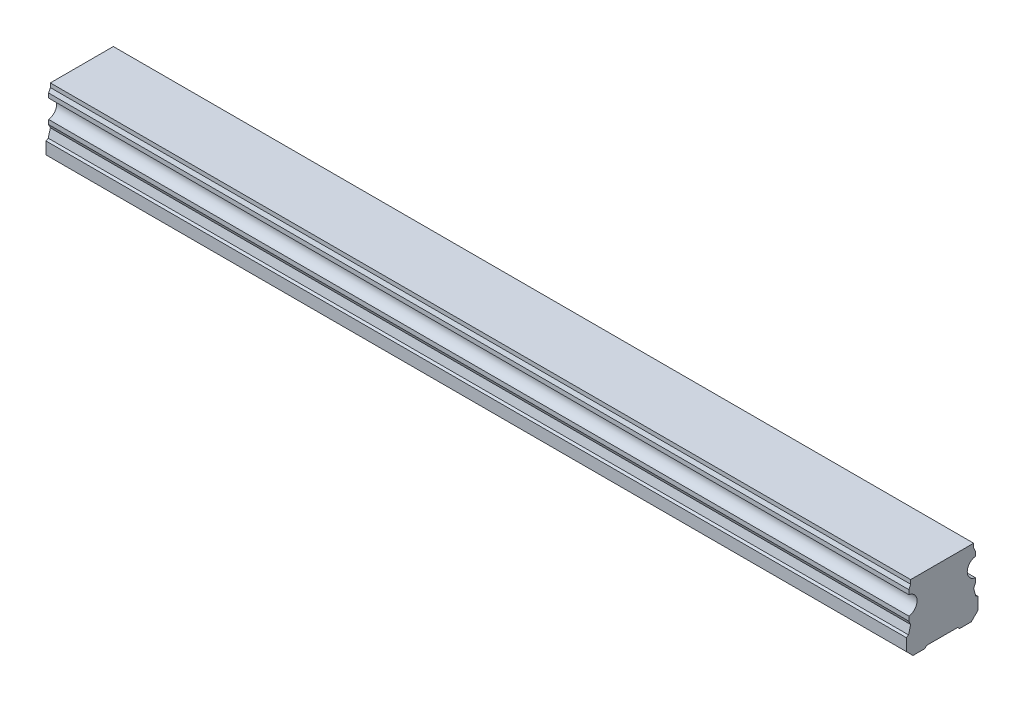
ISO-10303-21;
HEADER;
FILE_DESCRIPTION(('STEP AP214'),'2;1');
FILE_NAME('part.step','',(''),(''),'','','');
FILE_SCHEMA(('AUTOMOTIVE_DESIGN { 1 0 10303 214 1 1 1 1 }'));
ENDSEC;
DATA;
#1=APPLICATION_CONTEXT('core data for automotive mechanical design processes');
#2=APPLICATION_PROTOCOL_DEFINITION('international standard','automotive_design',2000,#1);
#3=PRODUCT_CONTEXT('',#1,'mechanical');
#4=PRODUCT('Part','Part','',(#3));
#5=PRODUCT_RELATED_PRODUCT_CATEGORY('part','',(#4));
#6=PRODUCT_DEFINITION_FORMATION('','',#4);
#7=PRODUCT_DEFINITION_CONTEXT('part definition',#1,'design');
#8=PRODUCT_DEFINITION('design','',#6,#7);
#9=PRODUCT_DEFINITION_SHAPE('','',#8);
#10=(LENGTH_UNIT() NAMED_UNIT(*) SI_UNIT(.MILLI.,.METRE.));
#11=(NAMED_UNIT(*) PLANE_ANGLE_UNIT() SI_UNIT($,.RADIAN.));
#12=(NAMED_UNIT(*) SI_UNIT($,.STERADIAN.) SOLID_ANGLE_UNIT());
#13=UNCERTAINTY_MEASURE_WITH_UNIT(LENGTH_MEASURE(1.E-05),#10,'distance_accuracy_value','');
#14=(GEOMETRIC_REPRESENTATION_CONTEXT(3) GLOBAL_UNCERTAINTY_ASSIGNED_CONTEXT((#13)) GLOBAL_UNIT_ASSIGNED_CONTEXT((#10,
#11,#12)) REPRESENTATION_CONTEXT('',''));
#15=CARTESIAN_POINT('',(0.,0.,0.));
#16=DIRECTION('',(0.,0.,1.));
#17=DIRECTION('',(1.,0.,0.));
#18=AXIS2_PLACEMENT_3D('',#15,#16,#17);
#19=CARTESIAN_POINT('',(150.,0.399999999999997,0.));
#20=DIRECTION('',(0.,-1.,0.));
#21=DIRECTION('',(0.,0.,-1.));
#22=AXIS2_PLACEMENT_3D('',#19,#20,#21);
#23=CONICAL_SURFACE('',#22,2.89999999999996,0.78539816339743);
#24=CARTESIAN_POINT('',(150.,0.799999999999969,0.));
#25=DIRECTION('',(0.,1.,0.));
#26=DIRECTION('',(0.,0.,1.));
#27=AXIS2_PLACEMENT_3D('',#24,#25,#26);
#28=CIRCLE('',#27,2.5);
#29=CARTESIAN_POINT('',(150.,0.799999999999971,2.5));
#30=VERTEX_POINT('',#29);
#31=EDGE_CURVE('E11',#30,#30,#28,.F.);
#32=ORIENTED_EDGE('',*,*,#31,.F.);
#33=EDGE_LOOP('',(#32));
#34=FACE_BOUND('',#33,.T.);
#35=CARTESIAN_POINT('',(150.,0.399999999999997,0.));
#36=DIRECTION('',(0.,1.,0.));
#37=DIRECTION('',(0.,0.,1.));
#38=AXIS2_PLACEMENT_3D('',#35,#36,#37);
#39=CIRCLE('',#38,2.89999999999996);
#40=CARTESIAN_POINT('',(150.,0.399999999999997,2.89999999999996));
#41=VERTEX_POINT('',#40);
#42=EDGE_CURVE('E433',#41,#41,#39,.T.);
#43=ORIENTED_EDGE('',*,*,#42,.F.);
#44=EDGE_LOOP('',(#43));
#45=FACE_BOUND('',#44,.T.);
#46=ADVANCED_FACE('F39',(#34,#45),#23,.F.);
#47=CARTESIAN_POINT('',(150.,7.,0.));
#48=DIRECTION('',(0.,-1.,0.));
#49=DIRECTION('',(0.,0.,-1.));
#50=AXIS2_PLACEMENT_3D('',#47,#48,#49);
#51=CYLINDRICAL_SURFACE('',#50,2.5);
#52=ORIENTED_EDGE('',*,*,#31,.T.);
#53=EDGE_LOOP('',(#52));
#54=FACE_BOUND('',#53,.T.);
#55=CARTESIAN_POINT('',(150.,7.,0.));
#56=DIRECTION('',(0.,-1.,0.));
#57=DIRECTION('',(0.,0.,-1.));
#58=AXIS2_PLACEMENT_3D('',#55,#56,#57);
#59=CIRCLE('',#58,2.5);
#60=CARTESIAN_POINT('',(150.,7.,-2.50000000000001));
#61=VERTEX_POINT('',#60);
#62=EDGE_CURVE('E49',#61,#61,#59,.T.);
#63=ORIENTED_EDGE('',*,*,#62,.F.);
#64=EDGE_LOOP('',(#63));
#65=FACE_BOUND('',#64,.T.);
#66=ADVANCED_FACE('F572',(#54,#65),#51,.F.);
#67=CARTESIAN_POINT('',(150.,7.,0.));
#68=DIRECTION('',(0.,-1.,0.));
#69=DIRECTION('',(0.,0.,-1.));
#70=AXIS2_PLACEMENT_3D('',#67,#68,#69);
#71=PLANE('',#70);
#72=CARTESIAN_POINT('',(150.,7.,0.));
#73=DIRECTION('',(0.,-1.,0.));
#74=DIRECTION('',(0.,0.,-1.));
#75=AXIS2_PLACEMENT_3D('',#72,#73,#74);
#76=CIRCLE('',#75,2.1);
#77=CARTESIAN_POINT('',(150.,7.,-2.1));
#78=VERTEX_POINT('',#77);
#79=EDGE_CURVE('E42',#78,#78,#76,.T.);
#80=ORIENTED_EDGE('',*,*,#79,.F.);
#81=EDGE_LOOP('',(#80));
#82=FACE_BOUND('',#81,.T.);
#83=ORIENTED_EDGE('',*,*,#62,.T.);
#84=EDGE_LOOP('',(#83));
#85=FACE_BOUND('',#84,.T.);
#86=ADVANCED_FACE('F577',(#82,#85),#71,.T.);
#87=CARTESIAN_POINT('',(180.,14.,-6.59000000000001));
#88=DIRECTION('',(0.,0.,1.));
#89=DIRECTION('',(0.,-1.,0.));
#90=AXIS2_PLACEMENT_3D('',#87,#88,#89);
#91=PLANE('',#90);
#92=DIRECTION('',(0.,1.,0.));
#93=VECTOR('',#92,1.);
#94=CARTESIAN_POINT('',(0.,14.,-6.59000000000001));
#95=LINE('',#94,#93);
#96=CARTESIAN_POINT('',(0.,13.15,-6.59));
#97=VERTEX_POINT('',#96);
#98=CARTESIAN_POINT('',(0.,14.,-6.59000000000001));
#99=VERTEX_POINT('',#98);
#100=EDGE_CURVE('E255',#97,#99,#95,.T.);
#101=ORIENTED_EDGE('',*,*,#100,.T.);
#102=DIRECTION('',(-1.,0.,0.));
#103=VECTOR('',#102,1.);
#104=CARTESIAN_POINT('',(180.,14.,-6.59000000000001));
#105=LINE('',#104,#103);
#106=CARTESIAN_POINT('',(180.,14.,-6.59000000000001));
#107=VERTEX_POINT('',#106);
#108=EDGE_CURVE('E422',#107,#99,#105,.T.);
#109=ORIENTED_EDGE('',*,*,#108,.F.);
#110=DIRECTION('',(0.,1.,0.));
#111=VECTOR('',#110,1.);
#112=CARTESIAN_POINT('',(180.,14.,-6.59000000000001));
#113=LINE('',#112,#111);
#114=CARTESIAN_POINT('',(180.,13.15,-6.59));
#115=VERTEX_POINT('',#114);
#116=EDGE_CURVE('E331',#115,#107,#113,.T.);
#117=ORIENTED_EDGE('',*,*,#116,.F.);
#118=DIRECTION('',(-1.,0.,0.));
#119=VECTOR('',#118,1.);
#120=CARTESIAN_POINT('',(180.,13.15,-6.59));
#121=LINE('',#120,#119);
#122=EDGE_CURVE('E251',#115,#97,#121,.T.);
#123=ORIENTED_EDGE('',*,*,#122,.T.);
#124=EDGE_LOOP('',(#101,#109,#117,#123));
#125=FACE_BOUND('',#124,.T.);
#126=ADVANCED_FACE('F559',(#125),#91,.F.);
#127=CARTESIAN_POINT('',(180.,14.,-6.59000000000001));
#128=DIRECTION('',(0.,-1.,0.));
#129=DIRECTION('',(0.,0.,-1.));
#130=AXIS2_PLACEMENT_3D('',#127,#128,#129);
#131=PLANE('',#130);
#132=DIRECTION('',(0.,0.,1.));
#133=VECTOR('',#132,1.);
#134=CARTESIAN_POINT('',(0.,14.,-6.59000000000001));
#135=LINE('',#134,#133);
#136=CARTESIAN_POINT('',(0.,14.,6.59));
#137=VERTEX_POINT('',#136);
#138=EDGE_CURVE('E259',#99,#137,#135,.T.);
#139=ORIENTED_EDGE('',*,*,#138,.T.);
#140=DIRECTION('',(-1.,0.,0.));
#141=VECTOR('',#140,1.);
#142=CARTESIAN_POINT('',(180.,14.,6.59));
#143=LINE('',#142,#141);
#144=CARTESIAN_POINT('',(180.,14.,6.59));
#145=VERTEX_POINT('',#144);
#146=EDGE_CURVE('E418',#145,#137,#143,.T.);
#147=ORIENTED_EDGE('',*,*,#146,.F.);
#148=DIRECTION('',(0.,0.,1.));
#149=VECTOR('',#148,1.);
#150=CARTESIAN_POINT('',(180.,14.,-6.59000000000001));
#151=LINE('',#150,#149);
#152=EDGE_CURVE('E157',#107,#145,#151,.T.);
#153=ORIENTED_EDGE('',*,*,#152,.F.);
#154=ORIENTED_EDGE('',*,*,#108,.T.);
#155=EDGE_LOOP('',(#139,#147,#153,#154));
#156=FACE_BOUND('',#155,.T.);
#157=ADVANCED_FACE('F644',(#156),#131,.F.);
#158=CARTESIAN_POINT('',(180.,14.,6.59));
#159=DIRECTION('',(0.,0.,-1.));
#160=DIRECTION('',(0.,1.,0.));
#161=AXIS2_PLACEMENT_3D('',#158,#159,#160);
#162=PLANE('',#161);
#163=DIRECTION('',(0.,-1.,0.));
#164=VECTOR('',#163,1.);
#165=CARTESIAN_POINT('',(0.,14.,6.59));
#166=LINE('',#165,#164);
#167=CARTESIAN_POINT('',(0.,13.15,6.59));
#168=VERTEX_POINT('',#167);
#169=EDGE_CURVE('E263',#137,#168,#166,.T.);
#170=ORIENTED_EDGE('',*,*,#169,.T.);
#171=DIRECTION('',(-1.,0.,0.));
#172=VECTOR('',#171,1.);
#173=CARTESIAN_POINT('',(180.,13.15,6.59));
#174=LINE('',#173,#172);
#175=CARTESIAN_POINT('',(180.,13.15,6.59));
#176=VERTEX_POINT('',#175);
#177=EDGE_CURVE('E414',#176,#168,#174,.T.);
#178=ORIENTED_EDGE('',*,*,#177,.F.);
#179=DIRECTION('',(0.,-1.,0.));
#180=VECTOR('',#179,1.);
#181=CARTESIAN_POINT('',(180.,14.,6.59));
#182=LINE('',#181,#180);
#183=EDGE_CURVE('E485',#145,#176,#182,.T.);
#184=ORIENTED_EDGE('',*,*,#183,.F.);
#185=ORIENTED_EDGE('',*,*,#146,.T.);
#186=EDGE_LOOP('',(#170,#178,#184,#185));
#187=FACE_BOUND('',#186,.T.);
#188=ADVANCED_FACE('F640',(#187),#162,.F.);
#189=CARTESIAN_POINT('',(180.,13.15,6.59));
#190=DIRECTION('',(0.,-0.422618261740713,-0.906307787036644));
#191=DIRECTION('',(0.,0.906307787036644,-0.422618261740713));
#192=AXIS2_PLACEMENT_3D('',#189,#190,#191);
#193=PLANE('',#192);
#194=DIRECTION('',(0.,-0.906307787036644,0.422618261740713));
#195=VECTOR('',#194,1.);
#196=CARTESIAN_POINT('',(0.,13.15,6.59));
#197=LINE('',#196,#195);
#198=CARTESIAN_POINT('',(0.,12.3565324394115,6.96));
#199=VERTEX_POINT('',#198);
#200=EDGE_CURVE('E266',#168,#199,#197,.T.);
#201=ORIENTED_EDGE('',*,*,#200,.T.);
#202=DIRECTION('',(-1.,0.,0.));
#203=VECTOR('',#202,1.);
#204=CARTESIAN_POINT('',(180.,12.3565324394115,6.96));
#205=LINE('',#204,#203);
#206=CARTESIAN_POINT('',(180.,12.3565324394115,6.96));
#207=VERTEX_POINT('',#206);
#208=EDGE_CURVE('E410',#207,#199,#205,.T.);
#209=ORIENTED_EDGE('',*,*,#208,.F.);
#210=DIRECTION('',(0.,-0.906307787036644,0.422618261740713));
#211=VECTOR('',#210,1.);
#212=CARTESIAN_POINT('',(180.,13.15,6.59));
#213=LINE('',#212,#211);
#214=EDGE_CURVE('E488',#176,#207,#213,.T.);
#215=ORIENTED_EDGE('',*,*,#214,.F.);
#216=ORIENTED_EDGE('',*,*,#177,.T.);
#217=EDGE_LOOP('',(#201,#209,#215,#216));
#218=FACE_BOUND('',#217,.T.);
#219=ADVANCED_FACE('F636',(#218),#193,.F.);
#220=CARTESIAN_POINT('',(180.,12.3565324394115,6.96));
#221=DIRECTION('',(0.,0.,-1.));
#222=DIRECTION('',(0.,1.,0.));
#223=AXIS2_PLACEMENT_3D('',#220,#221,#222);
#224=PLANE('',#223);
#225=DIRECTION('',(0.,-1.,0.));
#226=VECTOR('',#225,1.);
#227=CARTESIAN_POINT('',(0.,12.3565324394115,6.96));
#228=LINE('',#227,#226);
#229=CARTESIAN_POINT('',(0.,11.4351744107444,6.96));
#230=VERTEX_POINT('',#229);
#231=EDGE_CURVE('E269',#199,#230,#228,.T.);
#232=ORIENTED_EDGE('',*,*,#231,.T.);
#233=DIRECTION('',(-1.,0.,0.));
#234=VECTOR('',#233,1.);
#235=CARTESIAN_POINT('',(180.,11.4351744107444,6.96));
#236=LINE('',#235,#234);
#237=CARTESIAN_POINT('',(180.,11.4351744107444,6.96));
#238=VERTEX_POINT('',#237);
#239=EDGE_CURVE('E406',#238,#230,#236,.T.);
#240=ORIENTED_EDGE('',*,*,#239,.F.);
#241=DIRECTION('',(0.,-1.,0.));
#242=VECTOR('',#241,1.);
#243=CARTESIAN_POINT('',(180.,12.3565324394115,6.96));
#244=LINE('',#243,#242);
#245=EDGE_CURVE('E491',#207,#238,#244,.T.);
#246=ORIENTED_EDGE('',*,*,#245,.F.);
#247=ORIENTED_EDGE('',*,*,#208,.T.);
#248=EDGE_LOOP('',(#232,#240,#246,#247));
#249=FACE_BOUND('',#248,.T.);
#250=ADVANCED_FACE('F632',(#249),#224,.F.);
#251=CARTESIAN_POINT('',(180.,9.5,7.2));
#252=DIRECTION('',(-1.,0.,0.));
#253=DIRECTION('',(0.,0.,1.));
#254=AXIS2_PLACEMENT_3D('',#251,#252,#253);
#255=CYLINDRICAL_SURFACE('',#254,1.95);
#256=CARTESIAN_POINT('',(0.,9.5,7.2));
#257=DIRECTION('',(-1.,0.,0.));
#258=DIRECTION('',(0.,0.,-1.));
#259=AXIS2_PLACEMENT_3D('',#256,#257,#258);
#260=CIRCLE('',#259,1.95);
#261=CARTESIAN_POINT('',(0.,7.56482558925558,6.96));
#262=VERTEX_POINT('',#261);
#263=EDGE_CURVE('E272',#230,#262,#260,.T.);
#264=ORIENTED_EDGE('',*,*,#263,.T.);
#265=DIRECTION('',(-1.,0.,0.));
#266=VECTOR('',#265,1.);
#267=CARTESIAN_POINT('',(180.,7.56482558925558,6.96));
#268=LINE('',#267,#266);
#269=CARTESIAN_POINT('',(180.,7.56482558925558,6.96));
#270=VERTEX_POINT('',#269);
#271=EDGE_CURVE('E402',#270,#262,#268,.T.);
#272=ORIENTED_EDGE('',*,*,#271,.F.);
#273=CARTESIAN_POINT('',(180.,9.5,7.2));
#274=DIRECTION('',(-1.,0.,0.));
#275=DIRECTION('',(0.,0.,-1.));
#276=AXIS2_PLACEMENT_3D('',#273,#274,#275);
#277=CIRCLE('',#276,1.95);
#278=EDGE_CURVE('E494',#238,#270,#277,.T.);
#279=ORIENTED_EDGE('',*,*,#278,.F.);
#280=ORIENTED_EDGE('',*,*,#239,.T.);
#281=EDGE_LOOP('',(#264,#272,#279,#280));
#282=FACE_BOUND('',#281,.T.);
#283=ADVANCED_FACE('F628',(#282),#255,.F.);
#284=CARTESIAN_POINT('',(180.,7.56482558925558,6.96));
#285=DIRECTION('',(0.,0.,-1.));
#286=DIRECTION('',(0.,1.,0.));
#287=AXIS2_PLACEMENT_3D('',#284,#285,#286);
#288=PLANE('',#287);
#289=DIRECTION('',(0.,-1.,0.));
#290=VECTOR('',#289,1.);
#291=CARTESIAN_POINT('',(0.,7.56482558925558,6.96));
#292=LINE('',#291,#290);
#293=CARTESIAN_POINT('',(0.,6.64346756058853,6.96));
#294=VERTEX_POINT('',#293);
#295=EDGE_CURVE('E275',#262,#294,#292,.T.);
#296=ORIENTED_EDGE('',*,*,#295,.T.);
#297=DIRECTION('',(-1.,0.,0.));
#298=VECTOR('',#297,1.);
#299=CARTESIAN_POINT('',(180.,6.64346756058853,6.96));
#300=LINE('',#299,#298);
#301=CARTESIAN_POINT('',(180.,6.64346756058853,6.96));
#302=VERTEX_POINT('',#301);
#303=EDGE_CURVE('E398',#302,#294,#300,.T.);
#304=ORIENTED_EDGE('',*,*,#303,.F.);
#305=DIRECTION('',(0.,-1.,0.));
#306=VECTOR('',#305,1.);
#307=CARTESIAN_POINT('',(180.,7.56482558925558,6.96));
#308=LINE('',#307,#306);
#309=EDGE_CURVE('E497',#270,#302,#308,.T.);
#310=ORIENTED_EDGE('',*,*,#309,.F.);
#311=ORIENTED_EDGE('',*,*,#271,.T.);
#312=EDGE_LOOP('',(#296,#304,#310,#311));
#313=FACE_BOUND('',#312,.T.);
#314=ADVANCED_FACE('F624',(#313),#288,.F.);
#315=CARTESIAN_POINT('',(180.,6.64346756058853,6.96));
#316=DIRECTION('',(0.,0.422618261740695,-0.906307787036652));
#317=DIRECTION('',(0.,0.906307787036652,0.422618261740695));
#318=AXIS2_PLACEMENT_3D('',#315,#316,#317);
#319=PLANE('',#318);
#320=DIRECTION('',(0.,-0.906307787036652,-0.422618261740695));
#321=VECTOR('',#320,1.);
#322=CARTESIAN_POINT('',(0.,6.64346756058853,6.96));
#323=LINE('',#322,#321);
#324=CARTESIAN_POINT('',(0.,5.85,6.59000000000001));
#325=VERTEX_POINT('',#324);
#326=EDGE_CURVE('E278',#294,#325,#323,.T.);
#327=ORIENTED_EDGE('',*,*,#326,.T.);
#328=DIRECTION('',(-1.,0.,0.));
#329=VECTOR('',#328,1.);
#330=CARTESIAN_POINT('',(180.,5.85,6.59000000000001));
#331=LINE('',#330,#329);
#332=CARTESIAN_POINT('',(180.,5.85,6.59000000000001));
#333=VERTEX_POINT('',#332);
#334=EDGE_CURVE('E394',#333,#325,#331,.T.);
#335=ORIENTED_EDGE('',*,*,#334,.F.);
#336=DIRECTION('',(0.,-0.906307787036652,-0.422618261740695));
#337=VECTOR('',#336,1.);
#338=CARTESIAN_POINT('',(180.,6.64346756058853,6.96));
#339=LINE('',#338,#337);
#340=EDGE_CURVE('E500',#302,#333,#339,.T.);
#341=ORIENTED_EDGE('',*,*,#340,.F.);
#342=ORIENTED_EDGE('',*,*,#303,.T.);
#343=EDGE_LOOP('',(#327,#335,#341,#342));
#344=FACE_BOUND('',#343,.T.);
#345=ADVANCED_FACE('F620',(#344),#319,.F.);
#346=CARTESIAN_POINT('',(180.,5.85,6.59000000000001));
#347=DIRECTION('',(0.,-0.25881904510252,-0.965925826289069));
#348=DIRECTION('',(0.,0.965925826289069,-0.25881904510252));
#349=AXIS2_PLACEMENT_3D('',#346,#347,#348);
#350=PLANE('',#349);
#351=DIRECTION('',(0.,-0.965925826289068,0.25881904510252));
#352=VECTOR('',#351,1.);
#353=CARTESIAN_POINT('',(0.,5.85,6.59000000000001));
#354=LINE('',#353,#352);
#355=CARTESIAN_POINT('',(0.,4.2,7.03211616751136));
#356=VERTEX_POINT('',#355);
#357=EDGE_CURVE('E281',#325,#356,#354,.T.);
#358=ORIENTED_EDGE('',*,*,#357,.T.);
#359=DIRECTION('',(-1.,0.,0.));
#360=VECTOR('',#359,1.);
#361=CARTESIAN_POINT('',(180.,4.2,7.03211616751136));
#362=LINE('',#361,#360);
#363=CARTESIAN_POINT('',(180.,4.2,7.03211616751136));
#364=VERTEX_POINT('',#363);
#365=EDGE_CURVE('E390',#364,#356,#362,.T.);
#366=ORIENTED_EDGE('',*,*,#365,.F.);
#367=DIRECTION('',(0.,-0.965925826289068,0.25881904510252));
#368=VECTOR('',#367,1.);
#369=CARTESIAN_POINT('',(180.,5.85,6.59000000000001));
#370=LINE('',#369,#368);
#371=EDGE_CURVE('E503',#333,#364,#370,.T.);
#372=ORIENTED_EDGE('',*,*,#371,.F.);
#373=ORIENTED_EDGE('',*,*,#334,.T.);
#374=EDGE_LOOP('',(#358,#366,#372,#373));
#375=FACE_BOUND('',#374,.T.);
#376=ADVANCED_FACE('F616',(#375),#350,.F.);
#377=CARTESIAN_POINT('',(180.,4.2,7.03211616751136));
#378=DIRECTION('',(0.,-0.866025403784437,-0.500000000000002));
#379=DIRECTION('',(0.,0.500000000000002,-0.866025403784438));
#380=AXIS2_PLACEMENT_3D('',#377,#378,#379);
#381=PLANE('',#380);
#382=DIRECTION('',(0.,-0.500000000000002,0.866025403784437));
#383=VECTOR('',#382,1.);
#384=CARTESIAN_POINT('',(0.,4.2,7.03211616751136));
#385=LINE('',#384,#383);
#386=CARTESIAN_POINT('',(0.,3.92986714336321,7.5));
#387=VERTEX_POINT('',#386);
#388=EDGE_CURVE('E284',#356,#387,#385,.T.);
#389=ORIENTED_EDGE('',*,*,#388,.T.);
#390=DIRECTION('',(-1.,0.,0.));
#391=VECTOR('',#390,1.);
#392=CARTESIAN_POINT('',(180.,3.92986714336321,7.5));
#393=LINE('',#392,#391);
#394=CARTESIAN_POINT('',(180.,3.92986714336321,7.5));
#395=VERTEX_POINT('',#394);
#396=EDGE_CURVE('E386',#395,#387,#393,.T.);
#397=ORIENTED_EDGE('',*,*,#396,.F.);
#398=DIRECTION('',(0.,-0.500000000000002,0.866025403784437));
#399=VECTOR('',#398,1.);
#400=CARTESIAN_POINT('',(180.,4.2,7.03211616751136));
#401=LINE('',#400,#399);
#402=EDGE_CURVE('E506',#364,#395,#401,.T.);
#403=ORIENTED_EDGE('',*,*,#402,.F.);
#404=ORIENTED_EDGE('',*,*,#365,.T.);
#405=EDGE_LOOP('',(#389,#397,#403,#404));
#406=FACE_BOUND('',#405,.T.);
#407=ADVANCED_FACE('F612',(#406),#381,.F.);
#408=CARTESIAN_POINT('',(180.,3.92986714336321,7.5));
#409=DIRECTION('',(0.,0.,-1.));
#410=DIRECTION('',(0.,1.,0.));
#411=AXIS2_PLACEMENT_3D('',#408,#409,#410);
#412=PLANE('',#411);
#413=DIRECTION('',(0.,-1.,0.));
#414=VECTOR('',#413,1.);
#415=CARTESIAN_POINT('',(0.,3.92986714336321,7.5));
#416=LINE('',#415,#414);
#417=CARTESIAN_POINT('',(0.,1.4,7.5));
#418=VERTEX_POINT('',#417);
#419=EDGE_CURVE('E287',#387,#418,#416,.T.);
#420=ORIENTED_EDGE('',*,*,#419,.T.);
#421=DIRECTION('',(-1.,0.,0.));
#422=VECTOR('',#421,1.);
#423=CARTESIAN_POINT('',(180.,1.4,7.5));
#424=LINE('',#423,#422);
#425=CARTESIAN_POINT('',(180.,1.4,7.5));
#426=VERTEX_POINT('',#425);
#427=EDGE_CURVE('E382',#426,#418,#424,.T.);
#428=ORIENTED_EDGE('',*,*,#427,.F.);
#429=DIRECTION('',(0.,-1.,0.));
#430=VECTOR('',#429,1.);
#431=CARTESIAN_POINT('',(180.,3.92986714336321,7.5));
#432=LINE('',#431,#430);
#433=EDGE_CURVE('E509',#395,#426,#432,.T.);
#434=ORIENTED_EDGE('',*,*,#433,.F.);
#435=ORIENTED_EDGE('',*,*,#396,.T.);
#436=EDGE_LOOP('',(#420,#428,#434,#435));
#437=FACE_BOUND('',#436,.T.);
#438=ADVANCED_FACE('F608',(#437),#412,.F.);
#439=CARTESIAN_POINT('',(180.,1.4,7.5));
#440=DIRECTION('',(0.,0.707106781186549,-0.707106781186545));
#441=DIRECTION('',(0.,0.707106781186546,0.70710678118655));
#442=AXIS2_PLACEMENT_3D('',#439,#440,#441);
#443=PLANE('',#442);
#444=DIRECTION('',(0.,-0.707106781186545,-0.70710678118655));
#445=VECTOR('',#444,1.);
#446=CARTESIAN_POINT('',(0.,1.4,7.5));
#447=LINE('',#446,#445);
#448=CARTESIAN_POINT('',(0.,0.,6.1));
#449=VERTEX_POINT('',#448);
#450=EDGE_CURVE('E290',#418,#449,#447,.T.);
#451=ORIENTED_EDGE('',*,*,#450,.T.);
#452=DIRECTION('',(-1.,0.,0.));
#453=VECTOR('',#452,1.);
#454=CARTESIAN_POINT('',(180.,0.,6.1));
#455=LINE('',#454,#453);
#456=CARTESIAN_POINT('',(180.,0.,6.1));
#457=VERTEX_POINT('',#456);
#458=EDGE_CURVE('E378',#457,#449,#455,.T.);
#459=ORIENTED_EDGE('',*,*,#458,.F.);
#460=DIRECTION('',(0.,-0.707106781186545,-0.70710678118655));
#461=VECTOR('',#460,1.);
#462=CARTESIAN_POINT('',(180.,1.4,7.5));
#463=LINE('',#462,#461);
#464=EDGE_CURVE('E512',#426,#457,#463,.T.);
#465=ORIENTED_EDGE('',*,*,#464,.F.);
#466=ORIENTED_EDGE('',*,*,#427,.T.);
#467=EDGE_LOOP('',(#451,#459,#465,#466));
#468=FACE_BOUND('',#467,.T.);
#469=ADVANCED_FACE('F604',(#468),#443,.F.);
#470=CARTESIAN_POINT('',(180.,0.,6.1));
#471=DIRECTION('',(0.,1.,0.));
#472=DIRECTION('',(0.,0.,1.));
#473=AXIS2_PLACEMENT_3D('',#470,#471,#472);
#474=PLANE('',#473);
#475=DIRECTION('',(0.,0.,-1.));
#476=VECTOR('',#475,1.);
#477=CARTESIAN_POINT('',(0.,0.,6.1));
#478=LINE('',#477,#476);
#479=CARTESIAN_POINT('',(0.,0.,3.65));
#480=VERTEX_POINT('',#479);
#481=EDGE_CURVE('E293',#449,#480,#478,.T.);
#482=ORIENTED_EDGE('',*,*,#481,.T.);
#483=DIRECTION('',(-1.,0.,0.));
#484=VECTOR('',#483,1.);
#485=CARTESIAN_POINT('',(180.,0.,3.65));
#486=LINE('',#485,#484);
#487=CARTESIAN_POINT('',(180.,0.,3.65));
#488=VERTEX_POINT('',#487);
#489=EDGE_CURVE('E374',#488,#480,#486,.T.);
#490=ORIENTED_EDGE('',*,*,#489,.F.);
#491=DIRECTION('',(0.,0.,-1.));
#492=VECTOR('',#491,1.);
#493=CARTESIAN_POINT('',(180.,0.,6.1));
#494=LINE('',#493,#492);
#495=EDGE_CURVE('E515',#457,#488,#494,.T.);
#496=ORIENTED_EDGE('',*,*,#495,.F.);
#497=ORIENTED_EDGE('',*,*,#458,.T.);
#498=EDGE_LOOP('',(#482,#490,#496,#497));
#499=FACE_BOUND('',#498,.T.);
#500=ADVANCED_FACE('F596',(#499),#474,.F.);
#501=CARTESIAN_POINT('',(180.,0.,3.65));
#502=DIRECTION('',(0.,0.707106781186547,0.707106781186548));
#503=DIRECTION('',(0.,-0.707106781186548,0.707106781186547));
#504=AXIS2_PLACEMENT_3D('',#501,#502,#503);
#505=PLANE('',#504);
#506=DIRECTION('',(0.,0.707106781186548,-0.707106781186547));
#507=VECTOR('',#506,1.);
#508=CARTESIAN_POINT('',(0.,0.,3.65));
#509=LINE('',#508,#507);
#510=CARTESIAN_POINT('',(0.,0.399999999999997,3.25));
#511=VERTEX_POINT('',#510);
#512=EDGE_CURVE('E296',#480,#511,#509,.T.);
#513=ORIENTED_EDGE('',*,*,#512,.T.);
#514=DIRECTION('',(-1.,0.,0.));
#515=VECTOR('',#514,1.);
#516=CARTESIAN_POINT('',(180.,0.399999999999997,3.25));
#517=LINE('',#516,#515);
#518=CARTESIAN_POINT('',(180.,0.399999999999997,3.25));
#519=VERTEX_POINT('',#518);
#520=EDGE_CURVE('E370',#519,#511,#517,.T.);
#521=ORIENTED_EDGE('',*,*,#520,.F.);
#522=DIRECTION('',(0.,0.707106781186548,-0.707106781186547));
#523=VECTOR('',#522,1.);
#524=CARTESIAN_POINT('',(180.,0.,3.65));
#525=LINE('',#524,#523);
#526=EDGE_CURVE('E518',#488,#519,#525,.T.);
#527=ORIENTED_EDGE('',*,*,#526,.F.);
#528=ORIENTED_EDGE('',*,*,#489,.T.);
#529=EDGE_LOOP('',(#513,#521,#527,#528));
#530=FACE_BOUND('',#529,.T.);
#531=ADVANCED_FACE('F586',(#530),#505,.F.);
#532=CARTESIAN_POINT('',(180.,0.399999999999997,3.25));
#533=DIRECTION('',(0.,1.,0.));
#534=DIRECTION('',(0.,0.,1.));
#535=AXIS2_PLACEMENT_3D('',#532,#533,#534);
#536=PLANE('',#535);
#537=CARTESIAN_POINT('',(90.,0.399999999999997,0.));
#538=DIRECTION('',(0.,1.,0.));
#539=DIRECTION('',(0.,0.,1.));
#540=AXIS2_PLACEMENT_3D('',#537,#538,#539);
#541=CIRCLE('',#540,2.89999999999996);
#542=CARTESIAN_POINT('',(90.,0.399999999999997,2.89999999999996));
#543=VERTEX_POINT('',#542);
#544=EDGE_CURVE('E448',#543,#543,#541,.T.);
#545=ORIENTED_EDGE('',*,*,#544,.T.);
#546=EDGE_LOOP('',(#545));
#547=FACE_BOUND('',#546,.T.);
#548=CARTESIAN_POINT('',(30.,0.399999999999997,0.));
#549=DIRECTION('',(0.,1.,0.));
#550=DIRECTION('',(0.,0.,1.));
#551=AXIS2_PLACEMENT_3D('',#548,#549,#550);
#552=CIRCLE('',#551,2.89999999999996);
#553=CARTESIAN_POINT('',(30.,0.399999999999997,2.89999999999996));
#554=VERTEX_POINT('',#553);
#555=EDGE_CURVE('E425',#554,#554,#552,.T.);
#556=ORIENTED_EDGE('',*,*,#555,.T.);
#557=EDGE_LOOP('',(#556));
#558=FACE_BOUND('',#557,.T.);
#559=DIRECTION('',(0.,0.,-1.));
#560=VECTOR('',#559,1.);
#561=CARTESIAN_POINT('',(0.,0.399999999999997,3.25));
#562=LINE('',#561,#560);
#563=CARTESIAN_POINT('',(0.,0.399999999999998,-3.25));
#564=VERTEX_POINT('',#563);
#565=EDGE_CURVE('E298',#511,#564,#562,.T.);
#566=ORIENTED_EDGE('',*,*,#565,.T.);
#567=DIRECTION('',(-1.,0.,0.));
#568=VECTOR('',#567,1.);
#569=CARTESIAN_POINT('',(180.,0.399999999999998,-3.25));
#570=LINE('',#569,#568);
#571=CARTESIAN_POINT('',(180.,0.399999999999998,-3.25));
#572=VERTEX_POINT('',#571);
#573=EDGE_CURVE('E366',#572,#564,#570,.T.);
#574=ORIENTED_EDGE('',*,*,#573,.F.);
#575=DIRECTION('',(0.,0.,-1.));
#576=VECTOR('',#575,1.);
#577=CARTESIAN_POINT('',(180.,0.399999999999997,3.25));
#578=LINE('',#577,#576);
#579=EDGE_CURVE('E521',#519,#572,#578,.T.);
#580=ORIENTED_EDGE('',*,*,#579,.F.);
#581=ORIENTED_EDGE('',*,*,#520,.T.);
#582=EDGE_LOOP('',(#566,#574,#580,#581));
#583=FACE_BOUND('',#582,.T.);
#584=ORIENTED_EDGE('',*,*,#42,.T.);
#585=EDGE_LOOP('',(#584));
#586=FACE_BOUND('',#585,.T.);
#587=ADVANCED_FACE('F583',(#547,#558,#583,#586),#536,.F.);
#588=CARTESIAN_POINT('',(180.,0.399999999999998,-3.25));
#589=DIRECTION('',(0.,0.707106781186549,-0.707106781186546));
#590=DIRECTION('',(0.,0.707106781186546,0.707106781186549));
#591=AXIS2_PLACEMENT_3D('',#588,#589,#590);
#592=PLANE('',#591);
#593=DIRECTION('',(0.,-0.707106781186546,-0.707106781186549));
#594=VECTOR('',#593,1.);
#595=CARTESIAN_POINT('',(0.,0.399999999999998,-3.25));
#596=LINE('',#595,#594);
#597=CARTESIAN_POINT('',(0.,0.,-3.65));
#598=VERTEX_POINT('',#597);
#599=EDGE_CURVE('E301',#564,#598,#596,.T.);
#600=ORIENTED_EDGE('',*,*,#599,.T.);
#601=DIRECTION('',(-1.,0.,0.));
#602=VECTOR('',#601,1.);
#603=CARTESIAN_POINT('',(180.,0.,-3.65));
#604=LINE('',#603,#602);
#605=CARTESIAN_POINT('',(180.,0.,-3.65));
#606=VERTEX_POINT('',#605);
#607=EDGE_CURVE('E362',#606,#598,#604,.T.);
#608=ORIENTED_EDGE('',*,*,#607,.F.);
#609=DIRECTION('',(0.,-0.707106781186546,-0.707106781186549));
#610=VECTOR('',#609,1.);
#611=CARTESIAN_POINT('',(180.,0.399999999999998,-3.25));
#612=LINE('',#611,#610);
#613=EDGE_CURVE('E524',#572,#606,#612,.T.);
#614=ORIENTED_EDGE('',*,*,#613,.F.);
#615=ORIENTED_EDGE('',*,*,#573,.T.);
#616=EDGE_LOOP('',(#600,#608,#614,#615));
#617=FACE_BOUND('',#616,.T.);
#618=ADVANCED_FACE('F585',(#617),#592,.F.);
#619=CARTESIAN_POINT('',(180.,0.,-3.65));
#620=DIRECTION('',(0.,1.,0.));
#621=DIRECTION('',(0.,0.,1.));
#622=AXIS2_PLACEMENT_3D('',#619,#620,#621);
#623=PLANE('',#622);
#624=DIRECTION('',(0.,0.,-1.));
#625=VECTOR('',#624,1.);
#626=CARTESIAN_POINT('',(0.,0.,-3.65));
#627=LINE('',#626,#625);
#628=CARTESIAN_POINT('',(0.,0.,-6.1));
#629=VERTEX_POINT('',#628);
#630=EDGE_CURVE('E304',#598,#629,#627,.T.);
#631=ORIENTED_EDGE('',*,*,#630,.T.);
#632=DIRECTION('',(-1.,0.,0.));
#633=VECTOR('',#632,1.);
#634=CARTESIAN_POINT('',(180.,0.,-6.1));
#635=LINE('',#634,#633);
#636=CARTESIAN_POINT('',(180.,0.,-6.1));
#637=VERTEX_POINT('',#636);
#638=EDGE_CURVE('E358',#637,#629,#635,.T.);
#639=ORIENTED_EDGE('',*,*,#638,.F.);
#640=DIRECTION('',(0.,0.,-1.));
#641=VECTOR('',#640,1.);
#642=CARTESIAN_POINT('',(180.,0.,-3.65));
#643=LINE('',#642,#641);
#644=EDGE_CURVE('E527',#606,#637,#643,.T.);
#645=ORIENTED_EDGE('',*,*,#644,.F.);
#646=ORIENTED_EDGE('',*,*,#607,.T.);
#647=EDGE_LOOP('',(#631,#639,#645,#646));
#648=FACE_BOUND('',#647,.T.);
#649=ADVANCED_FACE('F593',(#648),#623,.F.);
#650=CARTESIAN_POINT('',(180.,0.,-6.1));
#651=DIRECTION('',(0.,0.707106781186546,0.707106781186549));
#652=DIRECTION('',(0.,-0.707106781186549,0.707106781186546));
#653=AXIS2_PLACEMENT_3D('',#650,#651,#652);
#654=PLANE('',#653);
#655=DIRECTION('',(0.,0.707106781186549,-0.707106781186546));
#656=VECTOR('',#655,1.);
#657=CARTESIAN_POINT('',(0.,0.,-6.1));
#658=LINE('',#657,#656);
#659=CARTESIAN_POINT('',(0.,1.4,-7.5));
#660=VERTEX_POINT('',#659);
#661=EDGE_CURVE('E307',#629,#660,#658,.T.);
#662=ORIENTED_EDGE('',*,*,#661,.T.);
#663=DIRECTION('',(-1.,0.,0.));
#664=VECTOR('',#663,1.);
#665=CARTESIAN_POINT('',(180.,1.4,-7.5));
#666=LINE('',#665,#664);
#667=CARTESIAN_POINT('',(180.,1.4,-7.5));
#668=VERTEX_POINT('',#667);
#669=EDGE_CURVE('E354',#668,#660,#666,.T.);
#670=ORIENTED_EDGE('',*,*,#669,.F.);
#671=DIRECTION('',(0.,0.707106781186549,-0.707106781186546));
#672=VECTOR('',#671,1.);
#673=CARTESIAN_POINT('',(180.,0.,-6.1));
#674=LINE('',#673,#672);
#675=EDGE_CURVE('E530',#637,#668,#674,.T.);
#676=ORIENTED_EDGE('',*,*,#675,.F.);
#677=ORIENTED_EDGE('',*,*,#638,.T.);
#678=EDGE_LOOP('',(#662,#670,#676,#677));
#679=FACE_BOUND('',#678,.T.);
#680=ADVANCED_FACE('F884',(#679),#654,.F.);
#681=CARTESIAN_POINT('',(180.,1.4,-7.5));
#682=DIRECTION('',(0.,0.,1.));
#683=DIRECTION('',(0.,-1.,0.));
#684=AXIS2_PLACEMENT_3D('',#681,#682,#683);
#685=PLANE('',#684);
#686=DIRECTION('',(0.,1.,0.));
#687=VECTOR('',#686,1.);
#688=CARTESIAN_POINT('',(0.,1.4,-7.5));
#689=LINE('',#688,#687);
#690=CARTESIAN_POINT('',(0.,3.92986714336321,-7.5));
#691=VERTEX_POINT('',#690);
#692=EDGE_CURVE('E310',#660,#691,#689,.T.);
#693=ORIENTED_EDGE('',*,*,#692,.T.);
#694=DIRECTION('',(-1.,0.,0.));
#695=VECTOR('',#694,1.);
#696=CARTESIAN_POINT('',(180.,3.92986714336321,-7.5));
#697=LINE('',#696,#695);
#698=CARTESIAN_POINT('',(180.,3.92986714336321,-7.5));
#699=VERTEX_POINT('',#698);
#700=EDGE_CURVE('E350',#699,#691,#697,.T.);
#701=ORIENTED_EDGE('',*,*,#700,.F.);
#702=DIRECTION('',(0.,1.,0.));
#703=VECTOR('',#702,1.);
#704=CARTESIAN_POINT('',(180.,1.4,-7.5));
#705=LINE('',#704,#703);
#706=EDGE_CURVE('E533',#668,#699,#705,.T.);
#707=ORIENTED_EDGE('',*,*,#706,.F.);
#708=ORIENTED_EDGE('',*,*,#669,.T.);
#709=EDGE_LOOP('',(#693,#701,#707,#708));
#710=FACE_BOUND('',#709,.T.);
#711=ADVANCED_FACE('F874',(#710),#685,.F.);
#712=CARTESIAN_POINT('',(180.,3.92986714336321,-7.5));
#713=DIRECTION('',(0.,-0.866025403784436,0.500000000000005));
#714=DIRECTION('',(0.,-0.500000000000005,-0.866025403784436));
#715=AXIS2_PLACEMENT_3D('',#712,#713,#714);
#716=PLANE('',#715);
#717=DIRECTION('',(0.,0.500000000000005,0.866025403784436));
#718=VECTOR('',#717,1.);
#719=CARTESIAN_POINT('',(0.,3.92986714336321,-7.5));
#720=LINE('',#719,#718);
#721=CARTESIAN_POINT('',(0.,4.2,-7.03211616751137));
#722=VERTEX_POINT('',#721);
#723=EDGE_CURVE('E313',#691,#722,#720,.T.);
#724=ORIENTED_EDGE('',*,*,#723,.T.);
#725=DIRECTION('',(-1.,0.,0.));
#726=VECTOR('',#725,1.);
#727=CARTESIAN_POINT('',(180.,4.2,-7.03211616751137));
#728=LINE('',#727,#726);
#729=CARTESIAN_POINT('',(180.,4.2,-7.03211616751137));
#730=VERTEX_POINT('',#729);
#731=EDGE_CURVE('E346',#730,#722,#728,.T.);
#732=ORIENTED_EDGE('',*,*,#731,.F.);
#733=DIRECTION('',(0.,0.500000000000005,0.866025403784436));
#734=VECTOR('',#733,1.);
#735=CARTESIAN_POINT('',(180.,3.92986714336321,-7.5));
#736=LINE('',#735,#734);
#737=EDGE_CURVE('E536',#699,#730,#736,.T.);
#738=ORIENTED_EDGE('',*,*,#737,.F.);
#739=ORIENTED_EDGE('',*,*,#700,.T.);
#740=EDGE_LOOP('',(#724,#732,#738,#739));
#741=FACE_BOUND('',#740,.T.);
#742=ADVANCED_FACE('F864',(#741),#716,.F.);
#743=CARTESIAN_POINT('',(180.,4.2,-7.03211616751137));
#744=DIRECTION('',(0.,-0.258819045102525,0.965925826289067));
#745=DIRECTION('',(0.,-0.965925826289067,-0.258819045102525));
#746=AXIS2_PLACEMENT_3D('',#743,#744,#745);
#747=PLANE('',#746);
#748=DIRECTION('',(0.,0.965925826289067,0.258819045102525));
#749=VECTOR('',#748,1.);
#750=CARTESIAN_POINT('',(0.,4.2,-7.03211616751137));
#751=LINE('',#750,#749);
#752=CARTESIAN_POINT('',(0.,5.85,-6.59000000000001));
#753=VERTEX_POINT('',#752);
#754=EDGE_CURVE('E316',#722,#753,#751,.T.);
#755=ORIENTED_EDGE('',*,*,#754,.T.);
#756=DIRECTION('',(-1.,0.,0.));
#757=VECTOR('',#756,1.);
#758=CARTESIAN_POINT('',(180.,5.85,-6.59000000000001));
#759=LINE('',#758,#757);
#760=CARTESIAN_POINT('',(180.,5.85,-6.59000000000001));
#761=VERTEX_POINT('',#760);
#762=EDGE_CURVE('E342',#761,#753,#759,.T.);
#763=ORIENTED_EDGE('',*,*,#762,.F.);
#764=DIRECTION('',(0.,0.965925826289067,0.258819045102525));
#765=VECTOR('',#764,1.);
#766=CARTESIAN_POINT('',(180.,4.2,-7.03211616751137));
#767=LINE('',#766,#765);
#768=EDGE_CURVE('E538',#730,#761,#767,.T.);
#769=ORIENTED_EDGE('',*,*,#768,.F.);
#770=ORIENTED_EDGE('',*,*,#731,.T.);
#771=EDGE_LOOP('',(#755,#763,#769,#770));
#772=FACE_BOUND('',#771,.T.);
#773=ADVANCED_FACE('F855',(#772),#747,.F.);
#774=CARTESIAN_POINT('',(180.,5.85,-6.59000000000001));
#775=DIRECTION('',(0.,0.422618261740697,0.906307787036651));
#776=DIRECTION('',(0.,-0.906307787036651,0.422618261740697));
#777=AXIS2_PLACEMENT_3D('',#774,#775,#776);
#778=PLANE('',#777);
#779=DIRECTION('',(0.,0.906307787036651,-0.422618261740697));
#780=VECTOR('',#779,1.);
#781=CARTESIAN_POINT('',(0.,5.85,-6.59000000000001));
#782=LINE('',#781,#780);
#783=CARTESIAN_POINT('',(0.,6.64346756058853,-6.96));
#784=VERTEX_POINT('',#783);
#785=EDGE_CURVE('E319',#753,#784,#782,.T.);
#786=ORIENTED_EDGE('',*,*,#785,.T.);
#787=DIRECTION('',(-1.,0.,0.));
#788=VECTOR('',#787,1.);
#789=CARTESIAN_POINT('',(180.,6.64346756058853,-6.96));
#790=LINE('',#789,#788);
#791=CARTESIAN_POINT('',(180.,6.64346756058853,-6.96));
#792=VERTEX_POINT('',#791);
#793=EDGE_CURVE('E338',#792,#784,#790,.T.);
#794=ORIENTED_EDGE('',*,*,#793,.F.);
#795=DIRECTION('',(0.,0.906307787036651,-0.422618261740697));
#796=VECTOR('',#795,1.);
#797=CARTESIAN_POINT('',(180.,5.85,-6.59000000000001));
#798=LINE('',#797,#796);
#799=EDGE_CURVE('E541',#761,#792,#798,.T.);
#800=ORIENTED_EDGE('',*,*,#799,.F.);
#801=ORIENTED_EDGE('',*,*,#762,.T.);
#802=EDGE_LOOP('',(#786,#794,#800,#801));
#803=FACE_BOUND('',#802,.T.);
#804=ADVANCED_FACE('F548',(#803),#778,.F.);
#805=CARTESIAN_POINT('',(180.,6.64346756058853,-6.96));
#806=DIRECTION('',(0.,0.,1.));
#807=DIRECTION('',(0.,-1.,0.));
#808=AXIS2_PLACEMENT_3D('',#805,#806,#807);
#809=PLANE('',#808);
#810=DIRECTION('',(0.,1.,0.));
#811=VECTOR('',#810,1.);
#812=CARTESIAN_POINT('',(0.,6.64346756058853,-6.96));
#813=LINE('',#812,#811);
#814=CARTESIAN_POINT('',(0.,7.56482558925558,-6.96));
#815=VERTEX_POINT('',#814);
#816=EDGE_CURVE('E322',#784,#815,#813,.T.);
#817=ORIENTED_EDGE('',*,*,#816,.T.);
#818=DIRECTION('',(-1.,0.,0.));
#819=VECTOR('',#818,1.);
#820=CARTESIAN_POINT('',(180.,7.56482558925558,-6.96));
#821=LINE('',#820,#819);
#822=CARTESIAN_POINT('',(180.,7.56482558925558,-6.96));
#823=VERTEX_POINT('',#822);
#824=EDGE_CURVE('E242',#823,#815,#821,.T.);
#825=ORIENTED_EDGE('',*,*,#824,.F.);
#826=DIRECTION('',(0.,1.,0.));
#827=VECTOR('',#826,1.);
#828=CARTESIAN_POINT('',(180.,6.64346756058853,-6.96));
#829=LINE('',#828,#827);
#830=EDGE_CURVE('E231',#792,#823,#829,.T.);
#831=ORIENTED_EDGE('',*,*,#830,.F.);
#832=ORIENTED_EDGE('',*,*,#793,.T.);
#833=EDGE_LOOP('',(#817,#825,#831,#832));
#834=FACE_BOUND('',#833,.T.);
#835=ADVANCED_FACE('F552',(#834),#809,.F.);
#836=CARTESIAN_POINT('',(180.,9.5,-7.2));
#837=DIRECTION('',(-1.,0.,0.));
#838=DIRECTION('',(0.,0.,1.));
#839=AXIS2_PLACEMENT_3D('',#836,#837,#838);
#840=CYLINDRICAL_SURFACE('',#839,1.95);
#841=CARTESIAN_POINT('',(0.,9.5,-7.2));
#842=DIRECTION('',(-1.,0.,0.));
#843=DIRECTION('',(0.,0.,-1.));
#844=AXIS2_PLACEMENT_3D('',#841,#842,#843);
#845=CIRCLE('',#844,1.95);
#846=CARTESIAN_POINT('',(0.,11.4351744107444,-6.96));
#847=VERTEX_POINT('',#846);
#848=EDGE_CURVE('E240',#815,#847,#845,.T.);
#849=ORIENTED_EDGE('',*,*,#848,.T.);
#850=DIRECTION('',(-1.,0.,0.));
#851=VECTOR('',#850,1.);
#852=CARTESIAN_POINT('',(180.,11.4351744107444,-6.96));
#853=LINE('',#852,#851);
#854=CARTESIAN_POINT('',(180.,11.4351744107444,-6.96));
#855=VERTEX_POINT('',#854);
#856=EDGE_CURVE('E237',#855,#847,#853,.T.);
#857=ORIENTED_EDGE('',*,*,#856,.F.);
#858=CARTESIAN_POINT('',(180.,9.5,-7.2));
#859=DIRECTION('',(-1.,0.,0.));
#860=DIRECTION('',(0.,0.,-1.));
#861=AXIS2_PLACEMENT_3D('',#858,#859,#860);
#862=CIRCLE('',#861,1.95);
#863=EDGE_CURVE('E225',#823,#855,#862,.T.);
#864=ORIENTED_EDGE('',*,*,#863,.F.);
#865=ORIENTED_EDGE('',*,*,#824,.T.);
#866=EDGE_LOOP('',(#849,#857,#864,#865));
#867=FACE_BOUND('',#866,.T.);
#868=ADVANCED_FACE('F238',(#867),#840,.F.);
#869=CARTESIAN_POINT('',(180.,12.3565324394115,-6.96));
#870=DIRECTION('',(0.,0.,1.));
#871=DIRECTION('',(0.,-1.,0.));
#872=AXIS2_PLACEMENT_3D('',#869,#870,#871);
#873=PLANE('',#872);
#874=DIRECTION('',(0.,1.,0.));
#875=VECTOR('',#874,1.);
#876=CARTESIAN_POINT('',(0.,12.3565324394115,-6.96));
#877=LINE('',#876,#875);
#878=CARTESIAN_POINT('',(0.,12.3565324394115,-6.96));
#879=VERTEX_POINT('',#878);
#880=EDGE_CURVE('E142',#847,#879,#877,.T.);
#881=ORIENTED_EDGE('',*,*,#880,.T.);
#882=DIRECTION('',(-1.,0.,0.));
#883=VECTOR('',#882,1.);
#884=CARTESIAN_POINT('',(180.,12.3565324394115,-6.96));
#885=LINE('',#884,#883);
#886=CARTESIAN_POINT('',(180.,12.3565324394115,-6.96));
#887=VERTEX_POINT('',#886);
#888=EDGE_CURVE('E243',#887,#879,#885,.T.);
#889=ORIENTED_EDGE('',*,*,#888,.F.);
#890=DIRECTION('',(0.,1.,0.));
#891=VECTOR('',#890,1.);
#892=CARTESIAN_POINT('',(180.,12.3565324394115,-6.96));
#893=LINE('',#892,#891);
#894=EDGE_CURVE('E229',#855,#887,#893,.T.);
#895=ORIENTED_EDGE('',*,*,#894,.F.);
#896=ORIENTED_EDGE('',*,*,#856,.T.);
#897=EDGE_LOOP('',(#881,#889,#895,#896));
#898=FACE_BOUND('',#897,.T.);
#899=ADVANCED_FACE('F245',(#898),#873,.F.);
#900=CARTESIAN_POINT('',(180.,13.15,-6.59));
#901=DIRECTION('',(0.,-0.422618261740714,0.906307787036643));
#902=DIRECTION('',(0.,-0.906307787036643,-0.422618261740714));
#903=AXIS2_PLACEMENT_3D('',#900,#901,#902);
#904=PLANE('',#903);
#905=DIRECTION('',(0.,0.906307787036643,0.422618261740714));
#906=VECTOR('',#905,1.);
#907=CARTESIAN_POINT('',(0.,13.15,-6.59));
#908=LINE('',#907,#906);
#909=EDGE_CURVE('E148',#879,#97,#908,.T.);
#910=ORIENTED_EDGE('',*,*,#909,.T.);
#911=ORIENTED_EDGE('',*,*,#122,.F.);
#912=DIRECTION('',(0.,0.906307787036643,0.422618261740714));
#913=VECTOR('',#912,1.);
#914=CARTESIAN_POINT('',(180.,13.15,-6.59));
#915=LINE('',#914,#913);
#916=EDGE_CURVE('E58',#887,#115,#915,.T.);
#917=ORIENTED_EDGE('',*,*,#916,.F.);
#918=ORIENTED_EDGE('',*,*,#888,.T.);
#919=EDGE_LOOP('',(#910,#911,#917,#918));
#920=FACE_BOUND('',#919,.T.);
#921=ADVANCED_FACE('F561',(#920),#904,.F.);
#922=CARTESIAN_POINT('',(180.,9.5,-7.2));
#923=DIRECTION('',(1.,0.,0.));
#924=DIRECTION('',(0.,0.,-1.));
#925=AXIS2_PLACEMENT_3D('',#922,#923,#924);
#926=PLANE('',#925);
#927=ORIENTED_EDGE('',*,*,#116,.T.);
#928=ORIENTED_EDGE('',*,*,#152,.T.);
#929=ORIENTED_EDGE('',*,*,#183,.T.);
#930=ORIENTED_EDGE('',*,*,#214,.T.);
#931=ORIENTED_EDGE('',*,*,#245,.T.);
#932=ORIENTED_EDGE('',*,*,#278,.T.);
#933=ORIENTED_EDGE('',*,*,#309,.T.);
#934=ORIENTED_EDGE('',*,*,#340,.T.);
#935=ORIENTED_EDGE('',*,*,#371,.T.);
#936=ORIENTED_EDGE('',*,*,#402,.T.);
#937=ORIENTED_EDGE('',*,*,#433,.T.);
#938=ORIENTED_EDGE('',*,*,#464,.T.);
#939=ORIENTED_EDGE('',*,*,#495,.T.);
#940=ORIENTED_EDGE('',*,*,#526,.T.);
#941=ORIENTED_EDGE('',*,*,#579,.T.);
#942=ORIENTED_EDGE('',*,*,#613,.T.);
#943=ORIENTED_EDGE('',*,*,#644,.T.);
#944=ORIENTED_EDGE('',*,*,#675,.T.);
#945=ORIENTED_EDGE('',*,*,#706,.T.);
#946=ORIENTED_EDGE('',*,*,#737,.T.);
#947=ORIENTED_EDGE('',*,*,#768,.T.);
#948=ORIENTED_EDGE('',*,*,#799,.T.);
#949=ORIENTED_EDGE('',*,*,#830,.T.);
#950=ORIENTED_EDGE('',*,*,#863,.T.);
#951=ORIENTED_EDGE('',*,*,#894,.T.);
#952=ORIENTED_EDGE('',*,*,#916,.T.);
#953=EDGE_LOOP('',(#927,#928,#929,#930,#931,#932,#933,#934,#935,#936,#937,#938,#939,#940,#941,
#942,#943,#944,#945,#946,#947,#948,#949,#950,#951,#952));
#954=FACE_BOUND('',#953,.T.);
#955=ADVANCED_FACE('F227',(#954),#926,.T.);
#956=CARTESIAN_POINT('',(0.,9.5,-7.2));
#957=DIRECTION('',(1.,0.,0.));
#958=DIRECTION('',(0.,0.,-1.));
#959=AXIS2_PLACEMENT_3D('',#956,#957,#958);
#960=PLANE('',#959);
#961=ORIENTED_EDGE('',*,*,#100,.F.);
#962=ORIENTED_EDGE('',*,*,#909,.F.);
#963=ORIENTED_EDGE('',*,*,#880,.F.);
#964=ORIENTED_EDGE('',*,*,#848,.F.);
#965=ORIENTED_EDGE('',*,*,#816,.F.);
#966=ORIENTED_EDGE('',*,*,#785,.F.);
#967=ORIENTED_EDGE('',*,*,#754,.F.);
#968=ORIENTED_EDGE('',*,*,#723,.F.);
#969=ORIENTED_EDGE('',*,*,#692,.F.);
#970=ORIENTED_EDGE('',*,*,#661,.F.);
#971=ORIENTED_EDGE('',*,*,#630,.F.);
#972=ORIENTED_EDGE('',*,*,#599,.F.);
#973=ORIENTED_EDGE('',*,*,#565,.F.);
#974=ORIENTED_EDGE('',*,*,#512,.F.);
#975=ORIENTED_EDGE('',*,*,#481,.F.);
#976=ORIENTED_EDGE('',*,*,#450,.F.);
#977=ORIENTED_EDGE('',*,*,#419,.F.);
#978=ORIENTED_EDGE('',*,*,#388,.F.);
#979=ORIENTED_EDGE('',*,*,#357,.F.);
#980=ORIENTED_EDGE('',*,*,#326,.F.);
#981=ORIENTED_EDGE('',*,*,#295,.F.);
#982=ORIENTED_EDGE('',*,*,#263,.F.);
#983=ORIENTED_EDGE('',*,*,#231,.F.);
#984=ORIENTED_EDGE('',*,*,#200,.F.);
#985=ORIENTED_EDGE('',*,*,#169,.F.);
#986=ORIENTED_EDGE('',*,*,#138,.F.);
#987=EDGE_LOOP('',(#961,#962,#963,#964,#965,#966,#967,#968,#969,#970,#971,#972,#973,#974,#975,
#976,#977,#978,#979,#980,#981,#982,#983,#984,#985,#986));
#988=FACE_BOUND('',#987,.T.);
#989=ADVANCED_FACE('F555',(#988),#960,.F.);
#990=CARTESIAN_POINT('',(30.,7.,0.));
#991=DIRECTION('',(0.,-1.,0.));
#992=DIRECTION('',(0.,0.,-1.));
#993=AXIS2_PLACEMENT_3D('',#990,#991,#992);
#994=CYLINDRICAL_SURFACE('',#993,2.5);
#995=CARTESIAN_POINT('',(30.,0.799999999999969,0.));
#996=DIRECTION('',(0.,1.,0.));
#997=DIRECTION('',(0.,0.,1.));
#998=AXIS2_PLACEMENT_3D('',#995,#996,#997);
#999=CIRCLE('',#998,2.5);
#1000=CARTESIAN_POINT('',(30.,0.799999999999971,2.5));
#1001=VERTEX_POINT('',#1000);
#1002=EDGE_CURVE('E429',#1001,#1001,#999,.F.);
#1003=ORIENTED_EDGE('',*,*,#1002,.T.);
#1004=EDGE_LOOP('',(#1003));
#1005=FACE_BOUND('',#1004,.T.);
#1006=CARTESIAN_POINT('',(30.,7.,0.));
#1007=DIRECTION('',(0.,-1.,0.));
#1008=DIRECTION('',(0.,0.,-1.));
#1009=AXIS2_PLACEMENT_3D('',#1006,#1007,#1008);
#1010=CIRCLE('',#1009,2.5);
#1011=CARTESIAN_POINT('',(30.,7.,-2.50000000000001));
#1012=VERTEX_POINT('',#1011);
#1013=EDGE_CURVE('E260',#1012,#1012,#1010,.T.);
#1014=ORIENTED_EDGE('',*,*,#1013,.F.);
#1015=EDGE_LOOP('',(#1014));
#1016=FACE_BOUND('',#1015,.T.);
#1017=ADVANCED_FACE('F702',(#1005,#1016),#994,.F.);
#1018=CARTESIAN_POINT('',(30.,7.,0.));
#1019=DIRECTION('',(0.,-1.,0.));
#1020=DIRECTION('',(0.,0.,-1.));
#1021=AXIS2_PLACEMENT_3D('',#1018,#1019,#1020);
#1022=PLANE('',#1021);
#1023=CARTESIAN_POINT('',(30.,7.,0.));
#1024=DIRECTION('',(0.,-1.,0.));
#1025=DIRECTION('',(0.,0.,-1.));
#1026=AXIS2_PLACEMENT_3D('',#1023,#1024,#1025);
#1027=CIRCLE('',#1026,2.1);
#1028=CARTESIAN_POINT('',(30.,7.,-2.1));
#1029=VERTEX_POINT('',#1028);
#1030=EDGE_CURVE('E474',#1029,#1029,#1027,.T.);
#1031=ORIENTED_EDGE('',*,*,#1030,.F.);
#1032=EDGE_LOOP('',(#1031));
#1033=FACE_BOUND('',#1032,.T.);
#1034=ORIENTED_EDGE('',*,*,#1013,.T.);
#1035=EDGE_LOOP('',(#1034));
#1036=FACE_BOUND('',#1035,.T.);
#1037=ADVANCED_FACE('F698',(#1033,#1036),#1022,.T.);
#1038=CARTESIAN_POINT('',(30.,9.5,0.));
#1039=DIRECTION('',(0.,-1.,0.));
#1040=DIRECTION('',(0.,0.,-1.));
#1041=AXIS2_PLACEMENT_3D('',#1038,#1039,#1040);
#1042=CYLINDRICAL_SURFACE('',#1041,2.1);
#1043=ORIENTED_EDGE('',*,*,#1030,.T.);
#1044=EDGE_LOOP('',(#1043));
#1045=FACE_BOUND('',#1044,.T.);
#1046=CARTESIAN_POINT('',(30.,9.5,0.));
#1047=DIRECTION('',(0.,-1.,0.));
#1048=DIRECTION('',(0.,0.,-1.));
#1049=AXIS2_PLACEMENT_3D('',#1046,#1047,#1048);
#1050=CIRCLE('',#1049,2.1);
#1051=CARTESIAN_POINT('',(30.,9.5,-2.1));
#1052=VERTEX_POINT('',#1051);
#1053=EDGE_CURVE('E470',#1052,#1052,#1050,.T.);
#1054=ORIENTED_EDGE('',*,*,#1053,.F.);
#1055=EDGE_LOOP('',(#1054));
#1056=FACE_BOUND('',#1055,.T.);
#1057=ADVANCED_FACE('F694',(#1045,#1056),#1042,.F.);
#1058=CARTESIAN_POINT('',(30.,9.5,0.));
#1059=DIRECTION('',(0.,-1.,0.));
#1060=DIRECTION('',(0.,0.,-1.));
#1061=AXIS2_PLACEMENT_3D('',#1058,#1059,#1060);
#1062=CONICAL_SURFACE('',#1061,2.1,1.0471975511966);
#1063=CARTESIAN_POINT('',(30.,10.7124355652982,0.));
#1064=VERTEX_POINT('',#1063);
#1065=VERTEX_LOOP('',#1064);
#1066=FACE_BOUND('',#1065,.T.);
#1067=ORIENTED_EDGE('',*,*,#1053,.T.);
#1068=EDGE_LOOP('',(#1067));
#1069=FACE_BOUND('',#1068,.T.);
#1070=ADVANCED_FACE('F654',(#1066,#1069),#1062,.F.);
#1071=CARTESIAN_POINT('',(30.,0.399999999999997,0.));
#1072=DIRECTION('',(0.,-1.,0.));
#1073=DIRECTION('',(0.,0.,-1.));
#1074=AXIS2_PLACEMENT_3D('',#1071,#1072,#1073);
#1075=CONICAL_SURFACE('',#1074,2.89999999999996,0.78539816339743);
#1076=ORIENTED_EDGE('',*,*,#1002,.F.);
#1077=EDGE_LOOP('',(#1076));
#1078=FACE_BOUND('',#1077,.T.);
#1079=ORIENTED_EDGE('',*,*,#555,.F.);
#1080=EDGE_LOOP('',(#1079));
#1081=FACE_BOUND('',#1080,.T.);
#1082=ADVANCED_FACE('F650',(#1078,#1081),#1075,.F.);
#1083=CARTESIAN_POINT('',(90.,7.,0.));
#1084=DIRECTION('',(0.,-1.,0.));
#1085=DIRECTION('',(0.,0.,-1.));
#1086=AXIS2_PLACEMENT_3D('',#1083,#1084,#1085);
#1087=PLANE('',#1086);
#1088=CARTESIAN_POINT('',(90.,7.,0.));
#1089=DIRECTION('',(0.,-1.,0.));
#1090=DIRECTION('',(0.,0.,-1.));
#1091=AXIS2_PLACEMENT_3D('',#1088,#1089,#1090);
#1092=CIRCLE('',#1091,2.1);
#1093=CARTESIAN_POINT('',(90.,7.,-2.1));
#1094=VERTEX_POINT('',#1093);
#1095=EDGE_CURVE('E439',#1094,#1094,#1092,.T.);
#1096=ORIENTED_EDGE('',*,*,#1095,.F.);
#1097=EDGE_LOOP('',(#1096));
#1098=FACE_BOUND('',#1097,.T.);
#1099=CARTESIAN_POINT('',(90.,7.,0.));
#1100=DIRECTION('',(0.,-1.,0.));
#1101=DIRECTION('',(0.,0.,-1.));
#1102=AXIS2_PLACEMENT_3D('',#1099,#1100,#1101);
#1103=CIRCLE('',#1102,2.5);
#1104=CARTESIAN_POINT('',(90.,7.,-2.50000000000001));
#1105=VERTEX_POINT('',#1104);
#1106=EDGE_CURVE('E466',#1105,#1105,#1103,.T.);
#1107=ORIENTED_EDGE('',*,*,#1106,.T.);
#1108=EDGE_LOOP('',(#1107));
#1109=FACE_BOUND('',#1108,.T.);
#1110=ADVANCED_FACE('F653',(#1098,#1109),#1087,.T.);
#1111=CARTESIAN_POINT('',(90.,7.,0.));
#1112=DIRECTION('',(0.,-1.,0.));
#1113=DIRECTION('',(0.,0.,-1.));
#1114=AXIS2_PLACEMENT_3D('',#1111,#1112,#1113);
#1115=CYLINDRICAL_SURFACE('',#1114,2.5);
#1116=CARTESIAN_POINT('',(90.,0.799999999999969,0.));
#1117=DIRECTION('',(0.,1.,0.));
#1118=DIRECTION('',(0.,0.,1.));
#1119=AXIS2_PLACEMENT_3D('',#1116,#1117,#1118);
#1120=CIRCLE('',#1119,2.5);
#1121=CARTESIAN_POINT('',(90.,0.799999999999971,2.5));
#1122=VERTEX_POINT('',#1121);
#1123=EDGE_CURVE('E462',#1122,#1122,#1120,.F.);
#1124=ORIENTED_EDGE('',*,*,#1123,.T.);
#1125=EDGE_LOOP('',(#1124));
#1126=FACE_BOUND('',#1125,.T.);
#1127=ORIENTED_EDGE('',*,*,#1106,.F.);
#1128=EDGE_LOOP('',(#1127));
#1129=FACE_BOUND('',#1128,.T.);
#1130=ADVANCED_FACE('F684',(#1126,#1129),#1115,.F.);
#1131=CARTESIAN_POINT('',(90.,0.399999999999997,0.));
#1132=DIRECTION('',(0.,-1.,0.));
#1133=DIRECTION('',(0.,0.,-1.));
#1134=AXIS2_PLACEMENT_3D('',#1131,#1132,#1133);
#1135=CONICAL_SURFACE('',#1134,2.89999999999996,0.78539816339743);
#1136=ORIENTED_EDGE('',*,*,#1123,.F.);
#1137=EDGE_LOOP('',(#1136));
#1138=FACE_BOUND('',#1137,.T.);
#1139=ORIENTED_EDGE('',*,*,#544,.F.);
#1140=EDGE_LOOP('',(#1139));
#1141=FACE_BOUND('',#1140,.T.);
#1142=ADVANCED_FACE('F681',(#1138,#1141),#1135,.F.);
#1143=CARTESIAN_POINT('',(90.,9.5,0.));
#1144=DIRECTION('',(0.,-1.,0.));
#1145=DIRECTION('',(0.,0.,-1.));
#1146=AXIS2_PLACEMENT_3D('',#1143,#1144,#1145);
#1147=CYLINDRICAL_SURFACE('',#1146,2.1);
#1148=ORIENTED_EDGE('',*,*,#1095,.T.);
#1149=EDGE_LOOP('',(#1148));
#1150=FACE_BOUND('',#1149,.T.);
#1151=CARTESIAN_POINT('',(90.,9.5,0.));
#1152=DIRECTION('',(0.,-1.,0.));
#1153=DIRECTION('',(0.,0.,-1.));
#1154=AXIS2_PLACEMENT_3D('',#1151,#1152,#1153);
#1155=CIRCLE('',#1154,2.1);
#1156=CARTESIAN_POINT('',(90.,9.5,-2.1));
#1157=VERTEX_POINT('',#1156);
#1158=EDGE_CURVE('E442',#1157,#1157,#1155,.T.);
#1159=ORIENTED_EDGE('',*,*,#1158,.F.);
#1160=EDGE_LOOP('',(#1159));
#1161=FACE_BOUND('',#1160,.T.);
#1162=ADVANCED_FACE('F678',(#1150,#1161),#1147,.F.);
#1163=CARTESIAN_POINT('',(60.,9.5,0.));
#1164=DIRECTION('',(0.,-1.,0.));
#1165=DIRECTION('',(0.,0.,-1.));
#1166=AXIS2_PLACEMENT_3D('',#1163,#1164,#1165);
#1167=PLANE('',#1166);
#1168=ORIENTED_EDGE('',*,*,#1158,.T.);
#1169=EDGE_LOOP('',(#1168));
#1170=FACE_BOUND('',#1169,.T.);
#1171=ADVANCED_FACE('F669',(#1170),#1167,.T.);
#1172=CARTESIAN_POINT('',(150.,9.5,0.));
#1173=DIRECTION('',(0.,-1.,0.));
#1174=DIRECTION('',(0.,0.,-1.));
#1175=AXIS2_PLACEMENT_3D('',#1172,#1173,#1174);
#1176=CYLINDRICAL_SURFACE('',#1175,2.1);
#1177=ORIENTED_EDGE('',*,*,#79,.T.);
#1178=EDGE_LOOP('',(#1177));
#1179=FACE_BOUND('',#1178,.T.);
#1180=CARTESIAN_POINT('',(150.,9.5,0.));
#1181=DIRECTION('',(0.,-1.,0.));
#1182=DIRECTION('',(0.,0.,-1.));
#1183=AXIS2_PLACEMENT_3D('',#1180,#1181,#1182);
#1184=CIRCLE('',#1183,2.1);
#1185=CARTESIAN_POINT('',(150.,9.5,-2.1));
#1186=VERTEX_POINT('',#1185);
#1187=EDGE_CURVE('E451',#1186,#1186,#1184,.T.);
#1188=ORIENTED_EDGE('',*,*,#1187,.F.);
#1189=EDGE_LOOP('',(#1188));
#1190=FACE_BOUND('',#1189,.T.);
#1191=ADVANCED_FACE('F665',(#1179,#1190),#1176,.F.);
#1192=CARTESIAN_POINT('',(120.,9.5,0.));
#1193=DIRECTION('',(0.,-1.,0.));
#1194=DIRECTION('',(0.,0.,-1.));
#1195=AXIS2_PLACEMENT_3D('',#1192,#1193,#1194);
#1196=PLANE('',#1195);
#1197=ORIENTED_EDGE('',*,*,#1187,.T.);
#1198=EDGE_LOOP('',(#1197));
#1199=FACE_BOUND('',#1198,.T.);
#1200=ADVANCED_FACE('F668',(#1199),#1196,.T.);
#1201=CLOSED_SHELL('',(#46,#66,#86,#126,#157,#188,#219,#250,#283,#314,#345,#376,#407,#438,#469,
#500,#531,#587,#618,#649,#680,#711,#742,#773,#804,#835,#868,#899,#921,#955,#989,#1017,#1037,
#1057,#1070,#1082,#1110,#1130,#1142,#1162,#1171,#1191,#1200));
#1202=MANIFOLD_SOLID_BREP('B2',#1201);
#1203=ADVANCED_BREP_SHAPE_REPRESENTATION('',(#18,#1202),#14);
#1204=SHAPE_DEFINITION_REPRESENTATION(#9,#1203);
ENDSEC;
END-ISO-10303-21;
